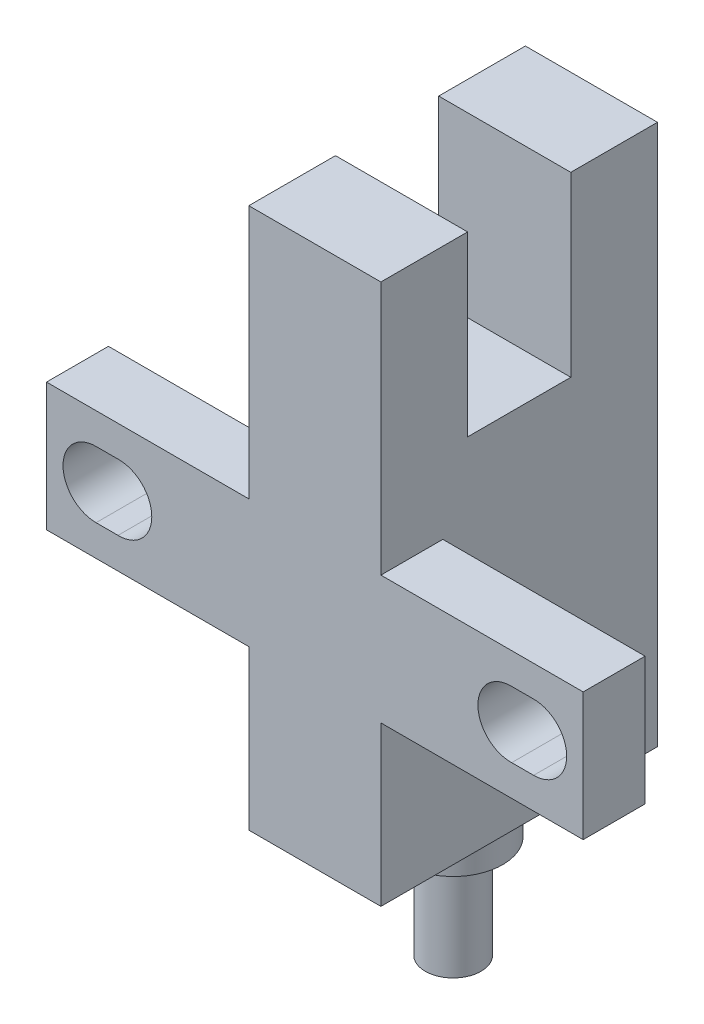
ISO-10303-21;
HEADER;
FILE_DESCRIPTION(('STEP AP214'),'2;1');
FILE_NAME('part.step','',(''),(''),'','','');
FILE_SCHEMA(('AUTOMOTIVE_DESIGN { 1 0 10303 214 1 1 1 1 }'));
ENDSEC;
DATA;
#1=APPLICATION_CONTEXT('core data for automotive mechanical design processes');
#2=APPLICATION_PROTOCOL_DEFINITION('international standard','automotive_design',2000,#1);
#3=PRODUCT_CONTEXT('',#1,'mechanical');
#4=PRODUCT('Part','Part','',(#3));
#5=PRODUCT_RELATED_PRODUCT_CATEGORY('part','',(#4));
#6=PRODUCT_DEFINITION_FORMATION('','',#4);
#7=PRODUCT_DEFINITION_CONTEXT('part definition',#1,'design');
#8=PRODUCT_DEFINITION('design','',#6,#7);
#9=PRODUCT_DEFINITION_SHAPE('','',#8);
#10=(LENGTH_UNIT() NAMED_UNIT(*) SI_UNIT(.MILLI.,.METRE.));
#11=(NAMED_UNIT(*) PLANE_ANGLE_UNIT() SI_UNIT($,.RADIAN.));
#12=(NAMED_UNIT(*) SI_UNIT($,.STERADIAN.) SOLID_ANGLE_UNIT());
#13=UNCERTAINTY_MEASURE_WITH_UNIT(LENGTH_MEASURE(1.E-05),#10,'distance_accuracy_value','');
#14=(GEOMETRIC_REPRESENTATION_CONTEXT(3) GLOBAL_UNCERTAINTY_ASSIGNED_CONTEXT((#13)) GLOBAL_UNIT_ASSIGNED_CONTEXT((#10,
#11,#12)) REPRESENTATION_CONTEXT('',''));
#15=CARTESIAN_POINT('',(0.,0.,0.));
#16=DIRECTION('',(0.,0.,1.));
#17=DIRECTION('',(1.,0.,0.));
#18=AXIS2_PLACEMENT_3D('',#15,#16,#17);
#19=CARTESIAN_POINT('',(-128.4344870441,13.2,-32.2));
#20=DIRECTION('',(0.,1.,0.));
#21=DIRECTION('',(0.,0.,1.));
#22=AXIS2_PLACEMENT_3D('',#19,#20,#21);
#23=PLANE('',#22);
#24=CARTESIAN_POINT('',(-128.4344870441,13.2,-32.2));
#25=DIRECTION('',(0.,1.,0.));
#26=DIRECTION('',(0.,0.,1.));
#27=AXIS2_PLACEMENT_3D('',#24,#25,#26);
#28=CIRCLE('',#27,1.35);
#29=CARTESIAN_POINT('',(-128.4344870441,13.2,-30.85));
#30=VERTEX_POINT('',#29);
#31=EDGE_CURVE('E20',#30,#30,#28,.T.);
#32=ORIENTED_EDGE('',*,*,#31,.F.);
#33=EDGE_LOOP('',(#32));
#34=FACE_BOUND('',#33,.T.);
#35=ADVANCED_FACE('F17',(#34),#23,.F.);
#36=CARTESIAN_POINT('',(-128.4344870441,13.06727663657,-32.2));
#37=DIRECTION('',(0.,1.,0.));
#38=DIRECTION('',(0.,0.,1.));
#39=AXIS2_PLACEMENT_3D('',#36,#37,#38);
#40=CYLINDRICAL_SURFACE('',#39,1.35);
#41=ORIENTED_EDGE('',*,*,#31,.T.);
#42=EDGE_LOOP('',(#41));
#43=FACE_BOUND('',#42,.T.);
#44=CARTESIAN_POINT('',(-128.4344870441,18.2,-32.2));
#45=DIRECTION('',(0.,1.,0.));
#46=DIRECTION('',(0.,0.,1.));
#47=AXIS2_PLACEMENT_3D('',#44,#45,#46);
#48=CIRCLE('',#47,1.35);
#49=CARTESIAN_POINT('',(-128.4344870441,18.2,-30.85));
#50=VERTEX_POINT('',#49);
#51=EDGE_CURVE('E242',#50,#50,#48,.F.);
#52=ORIENTED_EDGE('',*,*,#51,.T.);
#53=EDGE_LOOP('',(#52));
#54=FACE_BOUND('',#53,.T.);
#55=ADVANCED_FACE('F277',(#43,#54),#40,.T.);
#56=CARTESIAN_POINT('',(-128.4344870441,18.2,-32.2));
#57=DIRECTION('',(0.,1.,0.));
#58=DIRECTION('',(0.,0.,1.));
#59=AXIS2_PLACEMENT_3D('',#56,#57,#58);
#60=PLANE('',#59);
#61=ORIENTED_EDGE('',*,*,#51,.F.);
#62=EDGE_LOOP('',(#61));
#63=FACE_BOUND('',#62,.T.);
#64=CARTESIAN_POINT('',(-128.4344870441,18.2,-32.2));
#65=DIRECTION('',(0.,1.,0.));
#66=DIRECTION('',(0.,0.,1.));
#67=AXIS2_PLACEMENT_3D('',#64,#65,#66);
#68=CIRCLE('',#67,2.4);
#69=CARTESIAN_POINT('',(-128.4344870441,18.2,-29.8));
#70=VERTEX_POINT('',#69);
#71=EDGE_CURVE('E229',#70,#70,#68,.T.);
#72=ORIENTED_EDGE('',*,*,#71,.F.);
#73=EDGE_LOOP('',(#72));
#74=FACE_BOUND('',#73,.T.);
#75=ADVANCED_FACE('F284',(#63,#74),#60,.F.);
#76=CARTESIAN_POINT('',(-120.3344870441,31.,-28.5));
#77=DIRECTION('',(0.,0.,1.));
#78=DIRECTION('',(1.,0.,0.));
#79=AXIS2_PLACEMENT_3D('',#76,#77,#78);
#80=PLANE('',#79);
#81=CARTESIAN_POINT('',(-118.934115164,30.9995877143,-28.5));
#82=DIRECTION('',(0.,0.,-1.));
#83=DIRECTION('',(-1.,0.,0.));
#84=AXIS2_PLACEMENT_3D('',#81,#82,#83);
#85=CIRCLE('',#84,1.6);
#86=CARTESIAN_POINT('',(-118.934115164,32.5995877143,-28.5));
#87=VERTEX_POINT('',#86);
#88=CARTESIAN_POINT('',(-118.897795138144,29.4000000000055,-28.5));
#89=VERTEX_POINT('',#88);
#90=EDGE_CURVE('E188',#87,#89,#85,.F.);
#91=ORIENTED_EDGE('',*,*,#90,.T.);
#92=DIRECTION('',(1.,0.,0.));
#93=VECTOR('',#92,1.);
#94=CARTESIAN_POINT('',(-118.366141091,29.4,-28.5));
#95=LINE('',#94,#93);
#96=CARTESIAN_POINT('',(-117.8344870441,29.4,-28.5));
#97=VERTEX_POINT('',#96);
#98=EDGE_CURVE('E175',#97,#89,#95,.F.);
#99=ORIENTED_EDGE('',*,*,#98,.F.);
#100=CARTESIAN_POINT('',(-117.8344870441,31.,-28.5));
#101=DIRECTION('',(0.,0.,-1.));
#102=DIRECTION('',(-1.,0.,0.));
#103=AXIS2_PLACEMENT_3D('',#100,#101,#102);
#104=CIRCLE('',#103,1.6);
#105=CARTESIAN_POINT('',(-117.870807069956,32.5995877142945,-28.5));
#106=VERTEX_POINT('',#105);
#107=EDGE_CURVE('E178',#97,#106,#104,.F.);
#108=ORIENTED_EDGE('',*,*,#107,.T.);
#109=DIRECTION('',(1.,0.,0.));
#110=VECTOR('',#109,1.);
#111=CARTESIAN_POINT('',(-118.4024611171,32.5995877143,-28.5));
#112=LINE('',#111,#110);
#113=EDGE_CURVE('E182',#106,#87,#112,.F.);
#114=ORIENTED_EDGE('',*,*,#113,.T.);
#115=EDGE_LOOP('',(#91,#99,#108,#114));
#116=FACE_BOUND('',#115,.T.);
#117=DIRECTION('',(0.,1.,0.));
#118=VECTOR('',#117,1.);
#119=CARTESIAN_POINT('',(-125.2344870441,33.3,-28.5));
#120=LINE('',#119,#118);
#121=CARTESIAN_POINT('',(-125.2344870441,34.1,-28.5));
#122=VERTEX_POINT('',#121);
#123=CARTESIAN_POINT('',(-125.2344870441,27.9,-28.5));
#124=VERTEX_POINT('',#123);
#125=EDGE_CURVE('E206',#122,#124,#120,.F.);
#126=ORIENTED_EDGE('',*,*,#125,.F.);
#127=DIRECTION('',(1.,0.,0.));
#128=VECTOR('',#127,1.);
#129=CARTESIAN_POINT('',(-120.3344870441,34.1,-28.5));
#130=LINE('',#129,#128);
#131=CARTESIAN_POINT('',(-115.4344870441,34.1,-28.5));
#132=VERTEX_POINT('',#131);
#133=EDGE_CURVE('E216',#132,#122,#130,.F.);
#134=ORIENTED_EDGE('',*,*,#133,.F.);
#135=DIRECTION('',(0.,1.,0.));
#136=VECTOR('',#135,1.);
#137=CARTESIAN_POINT('',(-115.4344870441,31.,-28.5));
#138=LINE('',#137,#136);
#139=CARTESIAN_POINT('',(-115.4344870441,27.9,-28.5));
#140=VERTEX_POINT('',#139);
#141=EDGE_CURVE('E221',#140,#132,#138,.T.);
#142=ORIENTED_EDGE('',*,*,#141,.F.);
#143=DIRECTION('',(1.,0.,0.));
#144=VECTOR('',#143,1.);
#145=CARTESIAN_POINT('',(-120.3344870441,27.9,-28.5));
#146=LINE('',#145,#144);
#147=EDGE_CURVE('E226',#140,#124,#146,.F.);
#148=ORIENTED_EDGE('',*,*,#147,.T.);
#149=EDGE_LOOP('',(#126,#134,#142,#148));
#150=FACE_BOUND('',#149,.T.);
#151=ADVANCED_FACE('F180',(#116,#150),#80,.F.);
#152=CARTESIAN_POINT('',(-118.366141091,29.4,-27.));
#153=DIRECTION('',(0.,1.,0.));
#154=DIRECTION('',(0.,0.,1.));
#155=AXIS2_PLACEMENT_3D('',#152,#153,#154);
#156=PLANE('',#155);
#157=DIRECTION('',(0.,0.,-1.));
#158=VECTOR('',#157,1.);
#159=CARTESIAN_POINT('',(-117.8344870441,29.4,-25.36727663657));
#160=LINE('',#159,#158);
#161=CARTESIAN_POINT('',(-117.8344870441,29.4,-25.5));
#162=VERTEX_POINT('',#161);
#163=EDGE_CURVE('E189',#162,#97,#160,.T.);
#164=ORIENTED_EDGE('',*,*,#163,.T.);
#165=ORIENTED_EDGE('',*,*,#98,.T.);
#166=DIRECTION('',(0.,0.,-1.));
#167=VECTOR('',#166,1.);
#168=CARTESIAN_POINT('',(-118.8977951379,29.4000000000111,-25.36727663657));
#169=LINE('',#168,#167);
#170=CARTESIAN_POINT('',(-118.897795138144,29.4000000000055,-25.5));
#171=VERTEX_POINT('',#170);
#172=EDGE_CURVE('E209',#89,#171,#169,.F.);
#173=ORIENTED_EDGE('',*,*,#172,.T.);
#174=DIRECTION('',(1.,0.,0.));
#175=VECTOR('',#174,1.);
#176=CARTESIAN_POINT('',(-118.366141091,29.4,-25.5));
#177=LINE('',#176,#175);
#178=EDGE_CURVE('E240',#171,#162,#177,.T.);
#179=ORIENTED_EDGE('',*,*,#178,.T.);
#180=EDGE_LOOP('',(#164,#165,#173,#179));
#181=FACE_BOUND('',#180,.T.);
#182=ADVANCED_FACE('F384',(#181),#156,.T.);
#183=CARTESIAN_POINT('',(-118.4024611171,32.5995877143,-27.));
#184=DIRECTION('',(0.,1.,0.));
#185=DIRECTION('',(0.,0.,1.));
#186=AXIS2_PLACEMENT_3D('',#183,#184,#185);
#187=PLANE('',#186);
#188=DIRECTION('',(1.,0.,0.));
#189=VECTOR('',#188,1.);
#190=CARTESIAN_POINT('',(-118.4024611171,32.5995877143,-25.5));
#191=LINE('',#190,#189);
#192=CARTESIAN_POINT('',(-118.934115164,32.5995877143,-25.5));
#193=VERTEX_POINT('',#192);
#194=CARTESIAN_POINT('',(-117.870807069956,32.5995877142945,-25.5));
#195=VERTEX_POINT('',#194);
#196=EDGE_CURVE('E198',#193,#195,#191,.T.);
#197=ORIENTED_EDGE('',*,*,#196,.F.);
#198=DIRECTION('',(0.,0.,-1.));
#199=VECTOR('',#198,1.);
#200=CARTESIAN_POINT('',(-118.934115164,32.5995877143,-25.36727663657));
#201=LINE('',#200,#199);
#202=EDGE_CURVE('E197',#193,#87,#201,.T.);
#203=ORIENTED_EDGE('',*,*,#202,.T.);
#204=ORIENTED_EDGE('',*,*,#113,.F.);
#205=DIRECTION('',(0.,0.,-1.));
#206=VECTOR('',#205,1.);
#207=CARTESIAN_POINT('',(-117.8708070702,32.5995877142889,-25.36727663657));
#208=LINE('',#207,#206);
#209=EDGE_CURVE('E194',#106,#195,#208,.F.);
#210=ORIENTED_EDGE('',*,*,#209,.T.);
#211=EDGE_LOOP('',(#197,#203,#204,#210));
#212=FACE_BOUND('',#211,.T.);
#213=ADVANCED_FACE('F193',(#212),#187,.F.);
#214=CARTESIAN_POINT('',(-138.5028329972,29.4,-27.));
#215=DIRECTION('',(0.,1.,0.));
#216=DIRECTION('',(0.,0.,1.));
#217=AXIS2_PLACEMENT_3D('',#214,#215,#216);
#218=PLANE('',#217);
#219=DIRECTION('',(0.,0.,-1.));
#220=VECTOR('',#219,1.);
#221=CARTESIAN_POINT('',(-137.9711789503,29.4000000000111,-25.36727663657));
#222=LINE('',#221,#220);
#223=CARTESIAN_POINT('',(-137.971178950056,29.4000000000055,-25.5));
#224=VERTEX_POINT('',#223);
#225=CARTESIAN_POINT('',(-137.971178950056,29.4000000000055,-28.5));
#226=VERTEX_POINT('',#225);
#227=EDGE_CURVE('E421',#224,#226,#222,.T.);
#228=ORIENTED_EDGE('',*,*,#227,.T.);
#229=DIRECTION('',(1.,0.,0.));
#230=VECTOR('',#229,1.);
#231=CARTESIAN_POINT('',(-138.5028329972,29.4,-28.5));
#232=LINE('',#231,#230);
#233=CARTESIAN_POINT('',(-139.0344870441,29.4,-28.5));
#234=VERTEX_POINT('',#233);
#235=EDGE_CURVE('E234',#226,#234,#232,.F.);
#236=ORIENTED_EDGE('',*,*,#235,.T.);
#237=DIRECTION('',(0.,0.,-1.));
#238=VECTOR('',#237,1.);
#239=CARTESIAN_POINT('',(-139.0344870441,29.4,-25.36727663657));
#240=LINE('',#239,#238);
#241=CARTESIAN_POINT('',(-139.0344870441,29.4,-25.5));
#242=VERTEX_POINT('',#241);
#243=EDGE_CURVE('E418',#234,#242,#240,.F.);
#244=ORIENTED_EDGE('',*,*,#243,.T.);
#245=DIRECTION('',(1.,0.,0.));
#246=VECTOR('',#245,1.);
#247=CARTESIAN_POINT('',(-138.5028329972,29.4,-25.5));
#248=LINE('',#247,#246);
#249=EDGE_CURVE('E237',#242,#224,#248,.T.);
#250=ORIENTED_EDGE('',*,*,#249,.T.);
#251=EDGE_LOOP('',(#228,#236,#244,#250));
#252=FACE_BOUND('',#251,.T.);
#253=ADVANCED_FACE('F377',(#252),#218,.T.);
#254=CARTESIAN_POINT('',(-138.4665129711,32.5995877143,-27.));
#255=DIRECTION('',(0.,1.,0.));
#256=DIRECTION('',(0.,0.,1.));
#257=AXIS2_PLACEMENT_3D('',#254,#255,#256);
#258=PLANE('',#257);
#259=DIRECTION('',(1.,0.,0.));
#260=VECTOR('',#259,1.);
#261=CARTESIAN_POINT('',(-138.4665129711,32.5995877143,-25.5));
#262=LINE('',#261,#260);
#263=CARTESIAN_POINT('',(-138.998167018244,32.5995877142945,-25.5));
#264=VERTEX_POINT('',#263);
#265=CARTESIAN_POINT('',(-137.9348589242,32.5995877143,-25.5));
#266=VERTEX_POINT('',#265);
#267=EDGE_CURVE('E230',#264,#266,#262,.T.);
#268=ORIENTED_EDGE('',*,*,#267,.F.);
#269=DIRECTION('',(0.,0.,-1.));
#270=VECTOR('',#269,1.);
#271=CARTESIAN_POINT('',(-138.998167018,32.5995877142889,-25.36727663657));
#272=LINE('',#271,#270);
#273=CARTESIAN_POINT('',(-138.998167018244,32.5995877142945,-28.5));
#274=VERTEX_POINT('',#273);
#275=EDGE_CURVE('E415',#264,#274,#272,.T.);
#276=ORIENTED_EDGE('',*,*,#275,.T.);
#277=DIRECTION('',(1.,0.,0.));
#278=VECTOR('',#277,1.);
#279=CARTESIAN_POINT('',(-138.4665129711,32.5995877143,-28.5));
#280=LINE('',#279,#278);
#281=CARTESIAN_POINT('',(-137.9348589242,32.5995877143,-28.5));
#282=VERTEX_POINT('',#281);
#283=EDGE_CURVE('E232',#282,#274,#280,.F.);
#284=ORIENTED_EDGE('',*,*,#283,.F.);
#285=DIRECTION('',(0.,0.,-1.));
#286=VECTOR('',#285,1.);
#287=CARTESIAN_POINT('',(-137.9348589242,32.5995877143,-25.36727663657));
#288=LINE('',#287,#286);
#289=EDGE_CURVE('E424',#282,#266,#288,.F.);
#290=ORIENTED_EDGE('',*,*,#289,.T.);
#291=EDGE_LOOP('',(#268,#276,#284,#290));
#292=FACE_BOUND('',#291,.T.);
#293=ADVANCED_FACE('F373',(#292),#258,.F.);
#294=CARTESIAN_POINT('',(-128.4344870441,18.06727663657,-32.2));
#295=DIRECTION('',(0.,1.,0.));
#296=DIRECTION('',(0.,0.,1.));
#297=AXIS2_PLACEMENT_3D('',#294,#295,#296);
#298=CYLINDRICAL_SURFACE('',#297,2.4);
#299=ORIENTED_EDGE('',*,*,#71,.T.);
#300=EDGE_LOOP('',(#299));
#301=FACE_BOUND('',#300,.T.);
#302=CARTESIAN_POINT('',(-128.4344870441,20.2,-32.2));
#303=DIRECTION('',(0.,1.,0.));
#304=DIRECTION('',(0.,0.,1.));
#305=AXIS2_PLACEMENT_3D('',#302,#303,#304);
#306=CIRCLE('',#305,2.4);
#307=CARTESIAN_POINT('',(-128.4344870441,20.2,-29.8));
#308=VERTEX_POINT('',#307);
#309=EDGE_CURVE('E264',#308,#308,#306,.F.);
#310=ORIENTED_EDGE('',*,*,#309,.T.);
#311=EDGE_LOOP('',(#310));
#312=FACE_BOUND('',#311,.T.);
#313=ADVANCED_FACE('F369',(#301,#312),#298,.T.);
#314=CARTESIAN_POINT('',(-120.3344870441,27.9,-27.));
#315=DIRECTION('',(0.,1.,0.));
#316=DIRECTION('',(0.,0.,1.));
#317=AXIS2_PLACEMENT_3D('',#314,#315,#316);
#318=PLANE('',#317);
#319=ORIENTED_EDGE('',*,*,#147,.F.);
#320=DIRECTION('',(0.,0.,-1.));
#321=VECTOR('',#320,1.);
#322=CARTESIAN_POINT('',(-115.4344870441,27.9,-27.));
#323=LINE('',#322,#321);
#324=CARTESIAN_POINT('',(-115.4344870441,27.9,-25.5));
#325=VERTEX_POINT('',#324);
#326=EDGE_CURVE('E223',#325,#140,#323,.T.);
#327=ORIENTED_EDGE('',*,*,#326,.F.);
#328=DIRECTION('',(1.,0.,0.));
#329=VECTOR('',#328,1.);
#330=CARTESIAN_POINT('',(-128.4344870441,27.9,-25.5));
#331=LINE('',#330,#329);
#332=CARTESIAN_POINT('',(-125.2344870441,27.9,-25.5));
#333=VERTEX_POINT('',#332);
#334=EDGE_CURVE('E456',#333,#325,#331,.T.);
#335=ORIENTED_EDGE('',*,*,#334,.F.);
#336=DIRECTION('',(0.,0.,-1.));
#337=VECTOR('',#336,1.);
#338=CARTESIAN_POINT('',(-125.2344870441,27.9,-32.2));
#339=LINE('',#338,#337);
#340=EDGE_CURVE('E203',#124,#333,#339,.F.);
#341=ORIENTED_EDGE('',*,*,#340,.F.);
#342=EDGE_LOOP('',(#319,#327,#335,#341));
#343=FACE_BOUND('',#342,.T.);
#344=ADVANCED_FACE('F365',(#343),#318,.F.);
#345=CARTESIAN_POINT('',(-115.4344870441,31.,-27.));
#346=DIRECTION('',(1.,0.,0.));
#347=DIRECTION('',(0.,0.,-1.));
#348=AXIS2_PLACEMENT_3D('',#345,#346,#347);
#349=PLANE('',#348);
#350=DIRECTION('',(0.,0.,1.));
#351=VECTOR('',#350,1.);
#352=CARTESIAN_POINT('',(-115.4344870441,34.1,-27.));
#353=LINE('',#352,#351);
#354=CARTESIAN_POINT('',(-115.4344870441,34.1,-25.5));
#355=VERTEX_POINT('',#354);
#356=EDGE_CURVE('E218',#355,#132,#353,.F.);
#357=ORIENTED_EDGE('',*,*,#356,.F.);
#358=DIRECTION('',(0.,1.,0.));
#359=VECTOR('',#358,1.);
#360=CARTESIAN_POINT('',(-115.4344870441,33.3,-25.5));
#361=LINE('',#360,#359);
#362=EDGE_CURVE('E454',#325,#355,#361,.T.);
#363=ORIENTED_EDGE('',*,*,#362,.F.);
#364=ORIENTED_EDGE('',*,*,#326,.T.);
#365=ORIENTED_EDGE('',*,*,#141,.T.);
#366=EDGE_LOOP('',(#357,#363,#364,#365));
#367=FACE_BOUND('',#366,.T.);
#368=ADVANCED_FACE('F361',(#367),#349,.T.);
#369=CARTESIAN_POINT('',(-120.3344870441,34.1,-27.));
#370=DIRECTION('',(0.,1.,0.));
#371=DIRECTION('',(0.,0.,1.));
#372=AXIS2_PLACEMENT_3D('',#369,#370,#371);
#373=PLANE('',#372);
#374=DIRECTION('',(0.,0.,-1.));
#375=VECTOR('',#374,1.);
#376=CARTESIAN_POINT('',(-125.2344870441,34.1,-32.2));
#377=LINE('',#376,#375);
#378=CARTESIAN_POINT('',(-125.2344870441,34.1,-25.5));
#379=VERTEX_POINT('',#378);
#380=EDGE_CURVE('E213',#379,#122,#377,.T.);
#381=ORIENTED_EDGE('',*,*,#380,.F.);
#382=DIRECTION('',(1.,0.,0.));
#383=VECTOR('',#382,1.);
#384=CARTESIAN_POINT('',(-128.4344870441,34.1,-25.5));
#385=LINE('',#384,#383);
#386=EDGE_CURVE('E452',#355,#379,#385,.F.);
#387=ORIENTED_EDGE('',*,*,#386,.F.);
#388=ORIENTED_EDGE('',*,*,#356,.T.);
#389=ORIENTED_EDGE('',*,*,#133,.T.);
#390=EDGE_LOOP('',(#381,#387,#388,#389));
#391=FACE_BOUND('',#390,.T.);
#392=ADVANCED_FACE('F357',(#391),#373,.T.);
#393=CARTESIAN_POINT('',(-125.2344870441,33.3,-32.2));
#394=DIRECTION('',(1.,0.,0.));
#395=DIRECTION('',(0.,0.,-1.));
#396=AXIS2_PLACEMENT_3D('',#393,#394,#395);
#397=PLANE('',#396);
#398=DIRECTION('',(0.,0.,1.));
#399=VECTOR('',#398,1.);
#400=CARTESIAN_POINT('',(-125.2344870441,46.4,-27.6));
#401=LINE('',#400,#399);
#402=CARTESIAN_POINT('',(-125.2344870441,46.4,-25.5));
#403=VERTEX_POINT('',#402);
#404=CARTESIAN_POINT('',(-125.2344870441,46.4,-29.7));
#405=VERTEX_POINT('',#404);
#406=EDGE_CURVE('E465',#403,#405,#401,.F.);
#407=ORIENTED_EDGE('',*,*,#406,.F.);
#408=DIRECTION('',(0.,1.,0.));
#409=VECTOR('',#408,1.);
#410=CARTESIAN_POINT('',(-125.2344870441,33.3,-25.5));
#411=LINE('',#410,#409);
#412=EDGE_CURVE('E450',#379,#403,#411,.T.);
#413=ORIENTED_EDGE('',*,*,#412,.F.);
#414=ORIENTED_EDGE('',*,*,#380,.T.);
#415=ORIENTED_EDGE('',*,*,#125,.T.);
#416=ORIENTED_EDGE('',*,*,#340,.T.);
#417=DIRECTION('',(0.,1.,0.));
#418=VECTOR('',#417,1.);
#419=CARTESIAN_POINT('',(-125.2344870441,33.3,-25.5));
#420=LINE('',#419,#418);
#421=CARTESIAN_POINT('',(-125.2344870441,20.2,-25.5));
#422=VERTEX_POINT('',#421);
#423=EDGE_CURVE('E458',#422,#333,#420,.T.);
#424=ORIENTED_EDGE('',*,*,#423,.F.);
#425=DIRECTION('',(0.,0.,1.));
#426=VECTOR('',#425,1.);
#427=CARTESIAN_POINT('',(-125.2344870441,20.2,-32.2));
#428=LINE('',#427,#426);
#429=CARTESIAN_POINT('',(-125.2344870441,20.2,-38.9));
#430=VERTEX_POINT('',#429);
#431=EDGE_CURVE('E268',#422,#430,#428,.F.);
#432=ORIENTED_EDGE('',*,*,#431,.T.);
#433=DIRECTION('',(0.,1.,0.));
#434=VECTOR('',#433,1.);
#435=CARTESIAN_POINT('',(-125.2344870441,33.3,-38.9));
#436=LINE('',#435,#434);
#437=CARTESIAN_POINT('',(-125.2344870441,46.4,-38.9));
#438=VERTEX_POINT('',#437);
#439=EDGE_CURVE('E407',#430,#438,#436,.T.);
#440=ORIENTED_EDGE('',*,*,#439,.T.);
#441=DIRECTION('',(0.,0.,1.));
#442=VECTOR('',#441,1.);
#443=CARTESIAN_POINT('',(-125.2344870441,46.4,-36.8));
#444=LINE('',#443,#442);
#445=CARTESIAN_POINT('',(-125.2344870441,46.4,-34.7));
#446=VERTEX_POINT('',#445);
#447=EDGE_CURVE('E410',#446,#438,#444,.F.);
#448=ORIENTED_EDGE('',*,*,#447,.F.);
#449=DIRECTION('',(0.,1.,0.));
#450=VECTOR('',#449,1.);
#451=CARTESIAN_POINT('',(-125.2344870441,42.1,-34.7));
#452=LINE('',#451,#450);
#453=CARTESIAN_POINT('',(-125.2344870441,37.8,-34.7));
#454=VERTEX_POINT('',#453);
#455=EDGE_CURVE('E479',#454,#446,#452,.T.);
#456=ORIENTED_EDGE('',*,*,#455,.F.);
#457=DIRECTION('',(0.,0.,1.));
#458=VECTOR('',#457,1.);
#459=CARTESIAN_POINT('',(-125.2344870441,37.8,-32.2));
#460=LINE('',#459,#458);
#461=CARTESIAN_POINT('',(-125.2344870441,37.8,-29.7));
#462=VERTEX_POINT('',#461);
#463=EDGE_CURVE('E475',#462,#454,#460,.F.);
#464=ORIENTED_EDGE('',*,*,#463,.F.);
#465=DIRECTION('',(0.,1.,0.));
#466=VECTOR('',#465,1.);
#467=CARTESIAN_POINT('',(-125.2344870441,42.1,-29.7));
#468=LINE('',#467,#466);
#469=EDGE_CURVE('E467',#462,#405,#468,.T.);
#470=ORIENTED_EDGE('',*,*,#469,.T.);
#471=EDGE_LOOP('',(#407,#413,#414,#415,#416,#424,#432,#440,#448,#456,#464,#470));
#472=FACE_BOUND('',#471,.T.);
#473=ADVANCED_FACE('F354',(#472),#397,.T.);
#474=CARTESIAN_POINT('',(-117.8344870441,31.,-25.36727663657));
#475=DIRECTION('',(0.,0.,-1.));
#476=DIRECTION('',(-1.,0.,0.));
#477=AXIS2_PLACEMENT_3D('',#474,#475,#476);
#478=CYLINDRICAL_SURFACE('',#477,1.6);
#479=ORIENTED_EDGE('',*,*,#163,.F.);
#480=CARTESIAN_POINT('',(-117.8344870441,31.,-25.5));
#481=DIRECTION('',(0.,0.,-1.));
#482=DIRECTION('',(-1.,0.,0.));
#483=AXIS2_PLACEMENT_3D('',#480,#481,#482);
#484=CIRCLE('',#483,1.6);
#485=EDGE_CURVE('E202',#195,#162,#484,.T.);
#486=ORIENTED_EDGE('',*,*,#485,.F.);
#487=ORIENTED_EDGE('',*,*,#209,.F.);
#488=ORIENTED_EDGE('',*,*,#107,.F.);
#489=EDGE_LOOP('',(#479,#486,#487,#488));
#490=FACE_BOUND('',#489,.T.);
#491=ADVANCED_FACE('F200',(#490),#478,.F.);
#492=CARTESIAN_POINT('',(-118.934115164,30.9995877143,-25.36727663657));
#493=DIRECTION('',(0.,0.,-1.));
#494=DIRECTION('',(-1.,0.,0.));
#495=AXIS2_PLACEMENT_3D('',#492,#493,#494);
#496=CYLINDRICAL_SURFACE('',#495,1.6);
#497=CARTESIAN_POINT('',(-118.934115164,30.9995877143,-25.5));
#498=DIRECTION('',(0.,0.,-1.));
#499=DIRECTION('',(-1.,0.,0.));
#500=AXIS2_PLACEMENT_3D('',#497,#498,#499);
#501=CIRCLE('',#500,1.6);
#502=EDGE_CURVE('E259',#171,#193,#501,.T.);
#503=ORIENTED_EDGE('',*,*,#502,.F.);
#504=ORIENTED_EDGE('',*,*,#172,.F.);
#505=ORIENTED_EDGE('',*,*,#90,.F.);
#506=ORIENTED_EDGE('',*,*,#202,.F.);
#507=EDGE_LOOP('',(#503,#504,#505,#506));
#508=FACE_BOUND('',#507,.T.);
#509=ADVANCED_FACE('F347',(#508),#496,.F.);
#510=CARTESIAN_POINT('',(-137.9348589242,30.9995877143,-25.36727663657));
#511=DIRECTION('',(0.,0.,-1.));
#512=DIRECTION('',(-1.,0.,0.));
#513=AXIS2_PLACEMENT_3D('',#510,#511,#512);
#514=CYLINDRICAL_SURFACE('',#513,1.6);
#515=CARTESIAN_POINT('',(-137.9348589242,30.9995877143,-25.5));
#516=DIRECTION('',(0.,0.,-1.));
#517=DIRECTION('',(-1.,0.,0.));
#518=AXIS2_PLACEMENT_3D('',#515,#516,#517);
#519=CIRCLE('',#518,1.6);
#520=EDGE_CURVE('E256',#266,#224,#519,.T.);
#521=ORIENTED_EDGE('',*,*,#520,.F.);
#522=ORIENTED_EDGE('',*,*,#289,.F.);
#523=CARTESIAN_POINT('',(-137.9348589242,30.9995877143,-28.5));
#524=DIRECTION('',(0.,0.,-1.));
#525=DIRECTION('',(-1.,0.,0.));
#526=AXIS2_PLACEMENT_3D('',#523,#524,#525);
#527=CIRCLE('',#526,1.6);
#528=EDGE_CURVE('E248',#282,#226,#527,.T.);
#529=ORIENTED_EDGE('',*,*,#528,.T.);
#530=ORIENTED_EDGE('',*,*,#227,.F.);
#531=EDGE_LOOP('',(#521,#522,#529,#530));
#532=FACE_BOUND('',#531,.T.);
#533=ADVANCED_FACE('F343',(#532),#514,.F.);
#534=CARTESIAN_POINT('',(-139.0344870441,31.,-25.36727663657));
#535=DIRECTION('',(0.,0.,-1.));
#536=DIRECTION('',(-1.,0.,0.));
#537=AXIS2_PLACEMENT_3D('',#534,#535,#536);
#538=CYLINDRICAL_SURFACE('',#537,1.6);
#539=ORIENTED_EDGE('',*,*,#275,.F.);
#540=CARTESIAN_POINT('',(-139.0344870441,31.,-25.5));
#541=DIRECTION('',(0.,0.,-1.));
#542=DIRECTION('',(-1.,0.,0.));
#543=AXIS2_PLACEMENT_3D('',#540,#541,#542);
#544=CIRCLE('',#543,1.6);
#545=EDGE_CURVE('E252',#242,#264,#544,.T.);
#546=ORIENTED_EDGE('',*,*,#545,.F.);
#547=ORIENTED_EDGE('',*,*,#243,.F.);
#548=CARTESIAN_POINT('',(-139.0344870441,31.,-28.5));
#549=DIRECTION('',(0.,0.,-1.));
#550=DIRECTION('',(-1.,0.,0.));
#551=AXIS2_PLACEMENT_3D('',#548,#549,#550);
#552=CIRCLE('',#551,1.6);
#553=EDGE_CURVE('E244',#234,#274,#552,.T.);
#554=ORIENTED_EDGE('',*,*,#553,.T.);
#555=EDGE_LOOP('',(#539,#546,#547,#554));
#556=FACE_BOUND('',#555,.T.);
#557=ADVANCED_FACE('F339',(#556),#538,.F.);
#558=CARTESIAN_POINT('',(-141.4344870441,31.,-27.));
#559=DIRECTION('',(1.,0.,0.));
#560=DIRECTION('',(0.,0.,-1.));
#561=AXIS2_PLACEMENT_3D('',#558,#559,#560);
#562=PLANE('',#561);
#563=DIRECTION('',(0.,1.,0.));
#564=VECTOR('',#563,1.);
#565=CARTESIAN_POINT('',(-141.4344870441,31.,-28.5));
#566=LINE('',#565,#564);
#567=CARTESIAN_POINT('',(-141.4344870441,34.1,-28.5));
#568=VERTEX_POINT('',#567);
#569=CARTESIAN_POINT('',(-141.4344870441,27.9,-28.5));
#570=VERTEX_POINT('',#569);
#571=EDGE_CURVE('E441',#568,#570,#566,.F.);
#572=ORIENTED_EDGE('',*,*,#571,.T.);
#573=DIRECTION('',(0.,0.,1.));
#574=VECTOR('',#573,1.);
#575=CARTESIAN_POINT('',(-141.4344870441,27.9,-27.));
#576=LINE('',#575,#574);
#577=CARTESIAN_POINT('',(-141.4344870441,27.9,-25.5));
#578=VERTEX_POINT('',#577);
#579=EDGE_CURVE('E501',#570,#578,#576,.T.);
#580=ORIENTED_EDGE('',*,*,#579,.T.);
#581=DIRECTION('',(0.,1.,0.));
#582=VECTOR('',#581,1.);
#583=CARTESIAN_POINT('',(-141.4344870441,33.3,-25.5));
#584=LINE('',#583,#582);
#585=CARTESIAN_POINT('',(-141.4344870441,34.1,-25.5));
#586=VERTEX_POINT('',#585);
#587=EDGE_CURVE('E263',#586,#578,#584,.F.);
#588=ORIENTED_EDGE('',*,*,#587,.F.);
#589=DIRECTION('',(0.,0.,1.));
#590=VECTOR('',#589,1.);
#591=CARTESIAN_POINT('',(-141.4344870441,34.1,-27.));
#592=LINE('',#591,#590);
#593=EDGE_CURVE('E255',#568,#586,#592,.T.);
#594=ORIENTED_EDGE('',*,*,#593,.F.);
#595=EDGE_LOOP('',(#572,#580,#588,#594));
#596=FACE_BOUND('',#595,.T.);
#597=ADVANCED_FACE('F335',(#596),#562,.F.);
#598=CARTESIAN_POINT('',(-128.4344870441,20.2,-32.2));
#599=DIRECTION('',(0.,1.,0.));
#600=DIRECTION('',(0.,0.,1.));
#601=AXIS2_PLACEMENT_3D('',#598,#599,#600);
#602=PLANE('',#601);
#603=ORIENTED_EDGE('',*,*,#309,.F.);
#604=EDGE_LOOP('',(#603));
#605=FACE_BOUND('',#604,.T.);
#606=DIRECTION('',(1.,0.,0.));
#607=VECTOR('',#606,1.);
#608=CARTESIAN_POINT('',(-128.4344870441,20.2,-38.9));
#609=LINE('',#608,#607);
#610=CARTESIAN_POINT('',(-131.6344870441,20.2,-38.9));
#611=VERTEX_POINT('',#610);
#612=EDGE_CURVE('E267',#611,#430,#609,.T.);
#613=ORIENTED_EDGE('',*,*,#612,.T.);
#614=ORIENTED_EDGE('',*,*,#431,.F.);
#615=DIRECTION('',(1.,0.,0.));
#616=VECTOR('',#615,1.);
#617=CARTESIAN_POINT('',(-128.4344870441,20.2,-25.5));
#618=LINE('',#617,#616);
#619=CARTESIAN_POINT('',(-131.6344870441,20.2,-25.5));
#620=VERTEX_POINT('',#619);
#621=EDGE_CURVE('E461',#620,#422,#618,.T.);
#622=ORIENTED_EDGE('',*,*,#621,.F.);
#623=DIRECTION('',(0.,0.,-1.));
#624=VECTOR('',#623,1.);
#625=CARTESIAN_POINT('',(-131.6344870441,20.2,-32.2));
#626=LINE('',#625,#624);
#627=EDGE_CURVE('E403',#620,#611,#626,.T.);
#628=ORIENTED_EDGE('',*,*,#627,.T.);
#629=EDGE_LOOP('',(#613,#614,#622,#628));
#630=FACE_BOUND('',#629,.T.);
#631=ADVANCED_FACE('F331',(#605,#630),#602,.F.);
#632=CARTESIAN_POINT('',(-128.4344870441,33.3,-38.9));
#633=DIRECTION('',(0.,0.,1.));
#634=DIRECTION('',(1.,0.,0.));
#635=AXIS2_PLACEMENT_3D('',#632,#633,#634);
#636=PLANE('',#635);
#637=DIRECTION('',(1.,0.,0.));
#638=VECTOR('',#637,1.);
#639=CARTESIAN_POINT('',(-128.4344870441,46.4,-38.9));
#640=LINE('',#639,#638);
#641=CARTESIAN_POINT('',(-131.6344870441,46.4,-38.9));
#642=VERTEX_POINT('',#641);
#643=EDGE_CURVE('E481',#438,#642,#640,.F.);
#644=ORIENTED_EDGE('',*,*,#643,.F.);
#645=ORIENTED_EDGE('',*,*,#439,.F.);
#646=ORIENTED_EDGE('',*,*,#612,.F.);
#647=DIRECTION('',(0.,1.,0.));
#648=VECTOR('',#647,1.);
#649=CARTESIAN_POINT('',(-131.6344870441,33.3,-38.9));
#650=LINE('',#649,#648);
#651=EDGE_CURVE('E490',#611,#642,#650,.T.);
#652=ORIENTED_EDGE('',*,*,#651,.T.);
#653=EDGE_LOOP('',(#644,#645,#646,#652));
#654=FACE_BOUND('',#653,.T.);
#655=ADVANCED_FACE('F327',(#654),#636,.F.);
#656=CARTESIAN_POINT('',(-128.4344870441,46.4,-36.8));
#657=DIRECTION('',(0.,1.,0.));
#658=DIRECTION('',(0.,0.,1.));
#659=AXIS2_PLACEMENT_3D('',#656,#657,#658);
#660=PLANE('',#659);
#661=ORIENTED_EDGE('',*,*,#447,.T.);
#662=ORIENTED_EDGE('',*,*,#643,.T.);
#663=DIRECTION('',(0.,0.,-1.));
#664=VECTOR('',#663,1.);
#665=CARTESIAN_POINT('',(-131.6344870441,46.4,-32.2));
#666=LINE('',#665,#664);
#667=CARTESIAN_POINT('',(-131.6344870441,46.4,-34.7));
#668=VERTEX_POINT('',#667);
#669=EDGE_CURVE('E491',#642,#668,#666,.F.);
#670=ORIENTED_EDGE('',*,*,#669,.T.);
#671=DIRECTION('',(1.,0.,0.));
#672=VECTOR('',#671,1.);
#673=CARTESIAN_POINT('',(-128.4344870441,46.4,-34.7));
#674=LINE('',#673,#672);
#675=EDGE_CURVE('E477',#446,#668,#674,.F.);
#676=ORIENTED_EDGE('',*,*,#675,.F.);
#677=EDGE_LOOP('',(#661,#662,#670,#676));
#678=FACE_BOUND('',#677,.T.);
#679=ADVANCED_FACE('F323',(#678),#660,.T.);
#680=CARTESIAN_POINT('',(-128.4344870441,42.1,-34.7));
#681=DIRECTION('',(0.,0.,1.));
#682=DIRECTION('',(1.,0.,0.));
#683=AXIS2_PLACEMENT_3D('',#680,#681,#682);
#684=PLANE('',#683);
#685=ORIENTED_EDGE('',*,*,#455,.T.);
#686=ORIENTED_EDGE('',*,*,#675,.T.);
#687=DIRECTION('',(0.,1.,0.));
#688=VECTOR('',#687,1.);
#689=CARTESIAN_POINT('',(-131.6344870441,33.3,-34.7));
#690=LINE('',#689,#688);
#691=CARTESIAN_POINT('',(-131.6344870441,37.8,-34.7));
#692=VERTEX_POINT('',#691);
#693=EDGE_CURVE('E493',#668,#692,#690,.F.);
#694=ORIENTED_EDGE('',*,*,#693,.T.);
#695=DIRECTION('',(1.,0.,0.));
#696=VECTOR('',#695,1.);
#697=CARTESIAN_POINT('',(-128.4344870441,37.8,-34.7));
#698=LINE('',#697,#696);
#699=EDGE_CURVE('E473',#454,#692,#698,.F.);
#700=ORIENTED_EDGE('',*,*,#699,.F.);
#701=EDGE_LOOP('',(#685,#686,#694,#700));
#702=FACE_BOUND('',#701,.T.);
#703=ADVANCED_FACE('F319',(#702),#684,.T.);
#704=CARTESIAN_POINT('',(-128.4344870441,37.8,-32.2));
#705=DIRECTION('',(0.,1.,0.));
#706=DIRECTION('',(0.,0.,1.));
#707=AXIS2_PLACEMENT_3D('',#704,#705,#706);
#708=PLANE('',#707);
#709=ORIENTED_EDGE('',*,*,#463,.T.);
#710=ORIENTED_EDGE('',*,*,#699,.T.);
#711=DIRECTION('',(0.,0.,-1.));
#712=VECTOR('',#711,1.);
#713=CARTESIAN_POINT('',(-131.6344870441,37.8,-32.2));
#714=LINE('',#713,#712);
#715=CARTESIAN_POINT('',(-131.6344870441,37.8,-29.7));
#716=VERTEX_POINT('',#715);
#717=EDGE_CURVE('E520',#692,#716,#714,.F.);
#718=ORIENTED_EDGE('',*,*,#717,.T.);
#719=DIRECTION('',(1.,0.,0.));
#720=VECTOR('',#719,1.);
#721=CARTESIAN_POINT('',(-128.4344870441,37.8,-29.7));
#722=LINE('',#721,#720);
#723=EDGE_CURVE('E470',#716,#462,#722,.T.);
#724=ORIENTED_EDGE('',*,*,#723,.T.);
#725=EDGE_LOOP('',(#709,#710,#718,#724));
#726=FACE_BOUND('',#725,.T.);
#727=ADVANCED_FACE('F315',(#726),#708,.T.);
#728=CARTESIAN_POINT('',(-128.4344870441,42.1,-29.7));
#729=DIRECTION('',(0.,0.,1.));
#730=DIRECTION('',(1.,0.,0.));
#731=AXIS2_PLACEMENT_3D('',#728,#729,#730);
#732=PLANE('',#731);
#733=DIRECTION('',(1.,0.,0.));
#734=VECTOR('',#733,1.);
#735=CARTESIAN_POINT('',(-128.4344870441,46.4,-29.7));
#736=LINE('',#735,#734);
#737=CARTESIAN_POINT('',(-131.6344870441,46.4,-29.7));
#738=VERTEX_POINT('',#737);
#739=EDGE_CURVE('E463',#405,#738,#736,.F.);
#740=ORIENTED_EDGE('',*,*,#739,.F.);
#741=ORIENTED_EDGE('',*,*,#469,.F.);
#742=ORIENTED_EDGE('',*,*,#723,.F.);
#743=DIRECTION('',(0.,1.,0.));
#744=VECTOR('',#743,1.);
#745=CARTESIAN_POINT('',(-131.6344870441,33.3,-29.7));
#746=LINE('',#745,#744);
#747=EDGE_CURVE('E517',#716,#738,#746,.T.);
#748=ORIENTED_EDGE('',*,*,#747,.T.);
#749=EDGE_LOOP('',(#740,#741,#742,#748));
#750=FACE_BOUND('',#749,.T.);
#751=ADVANCED_FACE('F311',(#750),#732,.F.);
#752=CARTESIAN_POINT('',(-128.4344870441,46.4,-27.6));
#753=DIRECTION('',(0.,1.,0.));
#754=DIRECTION('',(0.,0.,1.));
#755=AXIS2_PLACEMENT_3D('',#752,#753,#754);
#756=PLANE('',#755);
#757=ORIENTED_EDGE('',*,*,#739,.T.);
#758=DIRECTION('',(0.,0.,-1.));
#759=VECTOR('',#758,1.);
#760=CARTESIAN_POINT('',(-131.6344870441,46.4,-32.2));
#761=LINE('',#760,#759);
#762=CARTESIAN_POINT('',(-131.6344870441,46.4,-25.5));
#763=VERTEX_POINT('',#762);
#764=EDGE_CURVE('E514',#738,#763,#761,.F.);
#765=ORIENTED_EDGE('',*,*,#764,.T.);
#766=DIRECTION('',(1.,0.,0.));
#767=VECTOR('',#766,1.);
#768=CARTESIAN_POINT('',(-128.4344870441,46.4,-25.5));
#769=LINE('',#768,#767);
#770=EDGE_CURVE('E448',#403,#763,#769,.F.);
#771=ORIENTED_EDGE('',*,*,#770,.F.);
#772=ORIENTED_EDGE('',*,*,#406,.T.);
#773=EDGE_LOOP('',(#757,#765,#771,#772));
#774=FACE_BOUND('',#773,.T.);
#775=ADVANCED_FACE('F307',(#774),#756,.T.);
#776=CARTESIAN_POINT('',(-128.4344870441,33.3,-25.5));
#777=DIRECTION('',(0.,0.,1.));
#778=DIRECTION('',(1.,0.,0.));
#779=AXIS2_PLACEMENT_3D('',#776,#777,#778);
#780=PLANE('',#779);
#781=ORIENTED_EDGE('',*,*,#249,.F.);
#782=ORIENTED_EDGE('',*,*,#545,.T.);
#783=ORIENTED_EDGE('',*,*,#267,.T.);
#784=ORIENTED_EDGE('',*,*,#520,.T.);
#785=EDGE_LOOP('',(#781,#782,#783,#784));
#786=FACE_BOUND('',#785,.T.);
#787=ORIENTED_EDGE('',*,*,#178,.F.);
#788=ORIENTED_EDGE('',*,*,#502,.T.);
#789=ORIENTED_EDGE('',*,*,#196,.T.);
#790=ORIENTED_EDGE('',*,*,#485,.T.);
#791=EDGE_LOOP('',(#787,#788,#789,#790));
#792=FACE_BOUND('',#791,.T.);
#793=DIRECTION('',(1.,0.,0.));
#794=VECTOR('',#793,1.);
#795=CARTESIAN_POINT('',(-136.5344870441,34.1,-25.5));
#796=LINE('',#795,#794);
#797=CARTESIAN_POINT('',(-131.6344870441,34.1,-25.5));
#798=VERTEX_POINT('',#797);
#799=EDGE_CURVE('E433',#586,#798,#796,.T.);
#800=ORIENTED_EDGE('',*,*,#799,.F.);
#801=ORIENTED_EDGE('',*,*,#587,.T.);
#802=DIRECTION('',(1.,0.,0.));
#803=VECTOR('',#802,1.);
#804=CARTESIAN_POINT('',(-136.5344870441,27.9,-25.5));
#805=LINE('',#804,#803);
#806=CARTESIAN_POINT('',(-131.6344870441,27.9,-25.5));
#807=VERTEX_POINT('',#806);
#808=EDGE_CURVE('E247',#578,#807,#805,.T.);
#809=ORIENTED_EDGE('',*,*,#808,.T.);
#810=DIRECTION('',(0.,1.,0.));
#811=VECTOR('',#810,1.);
#812=CARTESIAN_POINT('',(-131.6344870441,33.3,-25.5));
#813=LINE('',#812,#811);
#814=EDGE_CURVE('E495',#807,#620,#813,.F.);
#815=ORIENTED_EDGE('',*,*,#814,.T.);
#816=ORIENTED_EDGE('',*,*,#621,.T.);
#817=ORIENTED_EDGE('',*,*,#423,.T.);
#818=ORIENTED_EDGE('',*,*,#334,.T.);
#819=ORIENTED_EDGE('',*,*,#362,.T.);
#820=ORIENTED_EDGE('',*,*,#386,.T.);
#821=ORIENTED_EDGE('',*,*,#412,.T.);
#822=ORIENTED_EDGE('',*,*,#770,.T.);
#823=DIRECTION('',(0.,1.,0.));
#824=VECTOR('',#823,1.);
#825=CARTESIAN_POINT('',(-131.6344870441,33.3,-25.5));
#826=LINE('',#825,#824);
#827=EDGE_CURVE('E438',#763,#798,#826,.F.);
#828=ORIENTED_EDGE('',*,*,#827,.T.);
#829=EDGE_LOOP('',(#800,#801,#809,#815,#816,#817,#818,#819,#820,#821,#822,#828));
#830=FACE_BOUND('',#829,.T.);
#831=ADVANCED_FACE('F303',(#786,#792,#830),#780,.T.);
#832=CARTESIAN_POINT('',(-136.5344870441,34.1,-27.));
#833=DIRECTION('',(0.,1.,0.));
#834=DIRECTION('',(0.,0.,1.));
#835=AXIS2_PLACEMENT_3D('',#832,#833,#834);
#836=PLANE('',#835);
#837=ORIENTED_EDGE('',*,*,#593,.T.);
#838=ORIENTED_EDGE('',*,*,#799,.T.);
#839=DIRECTION('',(0.,0.,-1.));
#840=VECTOR('',#839,1.);
#841=CARTESIAN_POINT('',(-131.6344870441,34.1,-32.2));
#842=LINE('',#841,#840);
#843=CARTESIAN_POINT('',(-131.6344870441,34.1,-28.5));
#844=VERTEX_POINT('',#843);
#845=EDGE_CURVE('E507',#798,#844,#842,.T.);
#846=ORIENTED_EDGE('',*,*,#845,.T.);
#847=DIRECTION('',(1.,0.,0.));
#848=VECTOR('',#847,1.);
#849=CARTESIAN_POINT('',(-136.5344870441,34.1,-28.5));
#850=LINE('',#849,#848);
#851=EDGE_CURVE('E251',#844,#568,#850,.F.);
#852=ORIENTED_EDGE('',*,*,#851,.T.);
#853=EDGE_LOOP('',(#837,#838,#846,#852));
#854=FACE_BOUND('',#853,.T.);
#855=ADVANCED_FACE('F299',(#854),#836,.T.);
#856=CARTESIAN_POINT('',(-136.5344870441,31.,-28.5));
#857=DIRECTION('',(0.,0.,1.));
#858=DIRECTION('',(1.,0.,0.));
#859=AXIS2_PLACEMENT_3D('',#856,#857,#858);
#860=PLANE('',#859);
#861=ORIENTED_EDGE('',*,*,#553,.F.);
#862=ORIENTED_EDGE('',*,*,#235,.F.);
#863=ORIENTED_EDGE('',*,*,#528,.F.);
#864=ORIENTED_EDGE('',*,*,#283,.T.);
#865=EDGE_LOOP('',(#861,#862,#863,#864));
#866=FACE_BOUND('',#865,.T.);
#867=DIRECTION('',(0.,1.,0.));
#868=VECTOR('',#867,1.);
#869=CARTESIAN_POINT('',(-131.6344870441,33.3,-28.5));
#870=LINE('',#869,#868);
#871=CARTESIAN_POINT('',(-131.6344870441,27.9,-28.5));
#872=VERTEX_POINT('',#871);
#873=EDGE_CURVE('E26',#844,#872,#870,.F.);
#874=ORIENTED_EDGE('',*,*,#873,.T.);
#875=DIRECTION('',(1.,0.,0.));
#876=VECTOR('',#875,1.);
#877=CARTESIAN_POINT('',(-136.5344870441,27.9,-28.5));
#878=LINE('',#877,#876);
#879=EDGE_CURVE('E34',#872,#570,#878,.F.);
#880=ORIENTED_EDGE('',*,*,#879,.T.);
#881=ORIENTED_EDGE('',*,*,#571,.F.);
#882=ORIENTED_EDGE('',*,*,#851,.F.);
#883=EDGE_LOOP('',(#874,#880,#881,#882));
#884=FACE_BOUND('',#883,.T.);
#885=ADVANCED_FACE('F293',(#866,#884),#860,.F.);
#886=CARTESIAN_POINT('',(-136.5344870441,27.9,-27.));
#887=DIRECTION('',(0.,1.,0.));
#888=DIRECTION('',(0.,0.,1.));
#889=AXIS2_PLACEMENT_3D('',#886,#887,#888);
#890=PLANE('',#889);
#891=ORIENTED_EDGE('',*,*,#879,.F.);
#892=DIRECTION('',(0.,0.,-1.));
#893=VECTOR('',#892,1.);
#894=CARTESIAN_POINT('',(-131.6344870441,27.9,-32.2));
#895=LINE('',#894,#893);
#896=EDGE_CURVE('E11',#872,#807,#895,.F.);
#897=ORIENTED_EDGE('',*,*,#896,.T.);
#898=ORIENTED_EDGE('',*,*,#808,.F.);
#899=ORIENTED_EDGE('',*,*,#579,.F.);
#900=EDGE_LOOP('',(#891,#897,#898,#899));
#901=FACE_BOUND('',#900,.T.);
#902=ADVANCED_FACE('F287',(#901),#890,.F.);
#903=CARTESIAN_POINT('',(-131.6344870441,33.3,-32.2));
#904=DIRECTION('',(1.,0.,0.));
#905=DIRECTION('',(0.,0.,-1.));
#906=AXIS2_PLACEMENT_3D('',#903,#904,#905);
#907=PLANE('',#906);
#908=ORIENTED_EDGE('',*,*,#873,.F.);
#909=ORIENTED_EDGE('',*,*,#845,.F.);
#910=ORIENTED_EDGE('',*,*,#827,.F.);
#911=ORIENTED_EDGE('',*,*,#764,.F.);
#912=ORIENTED_EDGE('',*,*,#747,.F.);
#913=ORIENTED_EDGE('',*,*,#717,.F.);
#914=ORIENTED_EDGE('',*,*,#693,.F.);
#915=ORIENTED_EDGE('',*,*,#669,.F.);
#916=ORIENTED_EDGE('',*,*,#651,.F.);
#917=ORIENTED_EDGE('',*,*,#627,.F.);
#918=ORIENTED_EDGE('',*,*,#814,.F.);
#919=ORIENTED_EDGE('',*,*,#896,.F.);
#920=EDGE_LOOP('',(#908,#909,#910,#911,#912,#913,#914,#915,#916,#917,#918,#919));
#921=FACE_BOUND('',#920,.T.);
#922=ADVANCED_FACE('F285',(#921),#907,.F.);
#923=CLOSED_SHELL('',(#35,#55,#75,#151,#182,#213,#253,#293,#313,#344,#368,#392,#473,#491,#509,
#533,#557,#597,#631,#655,#679,#703,#727,#751,#775,#831,#855,#885,#902,#922));
#924=MANIFOLD_SOLID_BREP('B1',#923);
#925=ADVANCED_BREP_SHAPE_REPRESENTATION('',(#18,#924),#14);
#926=SHAPE_DEFINITION_REPRESENTATION(#9,#925);
ENDSEC;
END-ISO-10303-21;
